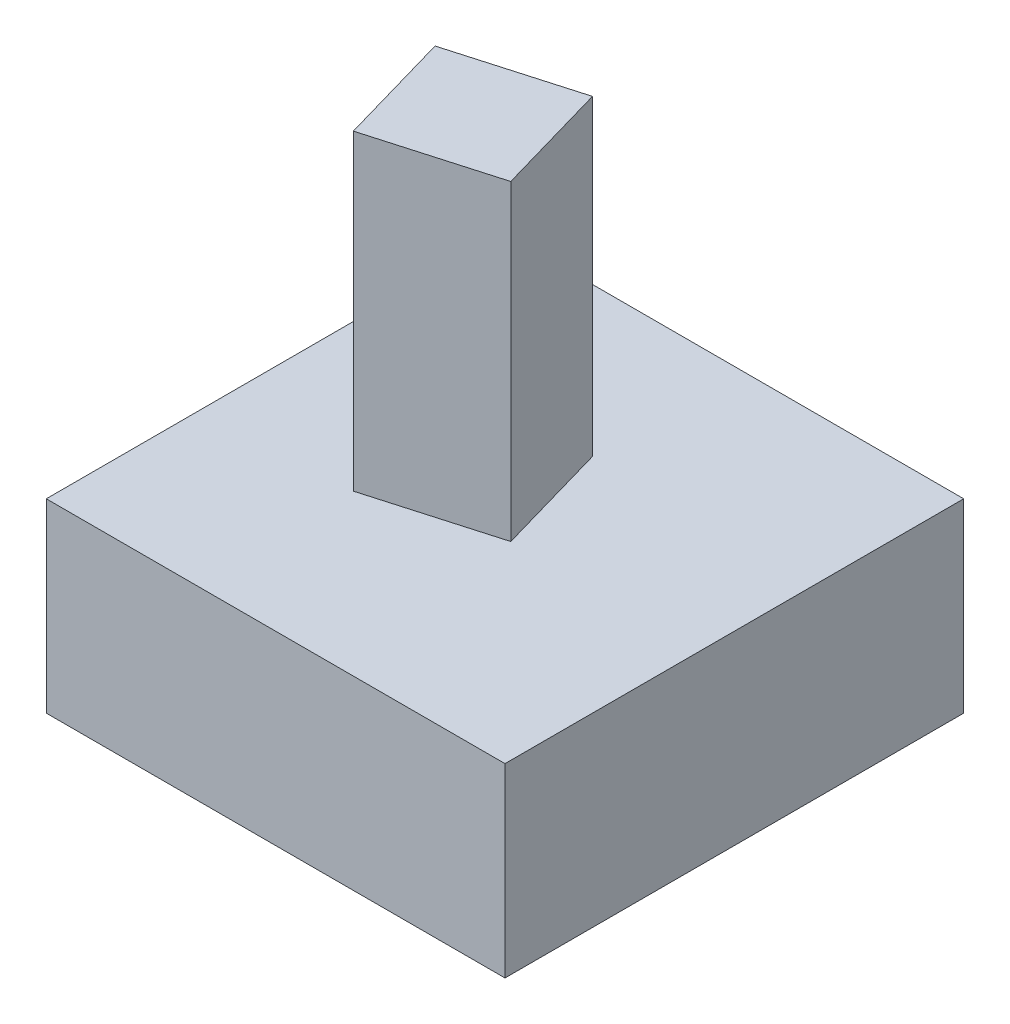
from build123d import *

# Parameters (mm, degrees)
SKETCH1_W      = 97.52724138
SKETCH1_H      = 97.52724138
EXTRUDE1_DEPTH = 39.473624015
SKETCH2_W      = 27.057243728
SKETCH2_H      = 25.334395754
EXTRUDE2_DEPTH = 66.296473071


with BuildPart() as part:
    # Sketch1 → Extrude1 (new body)
    with BuildSketch(Plane(origin=(0, 0, 0), x_dir=(1, 0, 0), z_dir=(0, 1, 0))):
        Rectangle(SKETCH1_W, SKETCH1_H)
    extrude(amount=EXTRUDE1_DEPTH)

    # Sketch2 → Extrude2 (add)
    with BuildSketch(Plane(origin=(-8.011231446, 39.473624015, -1.191670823), x_dir=(-0.9612616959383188, 0, 0.27563735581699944), z_dir=(0, 1, 0))):
        Rectangle(SKETCH2_W, SKETCH2_H)
    extrude(amount=EXTRUDE2_DEPTH)


solid = part.part
